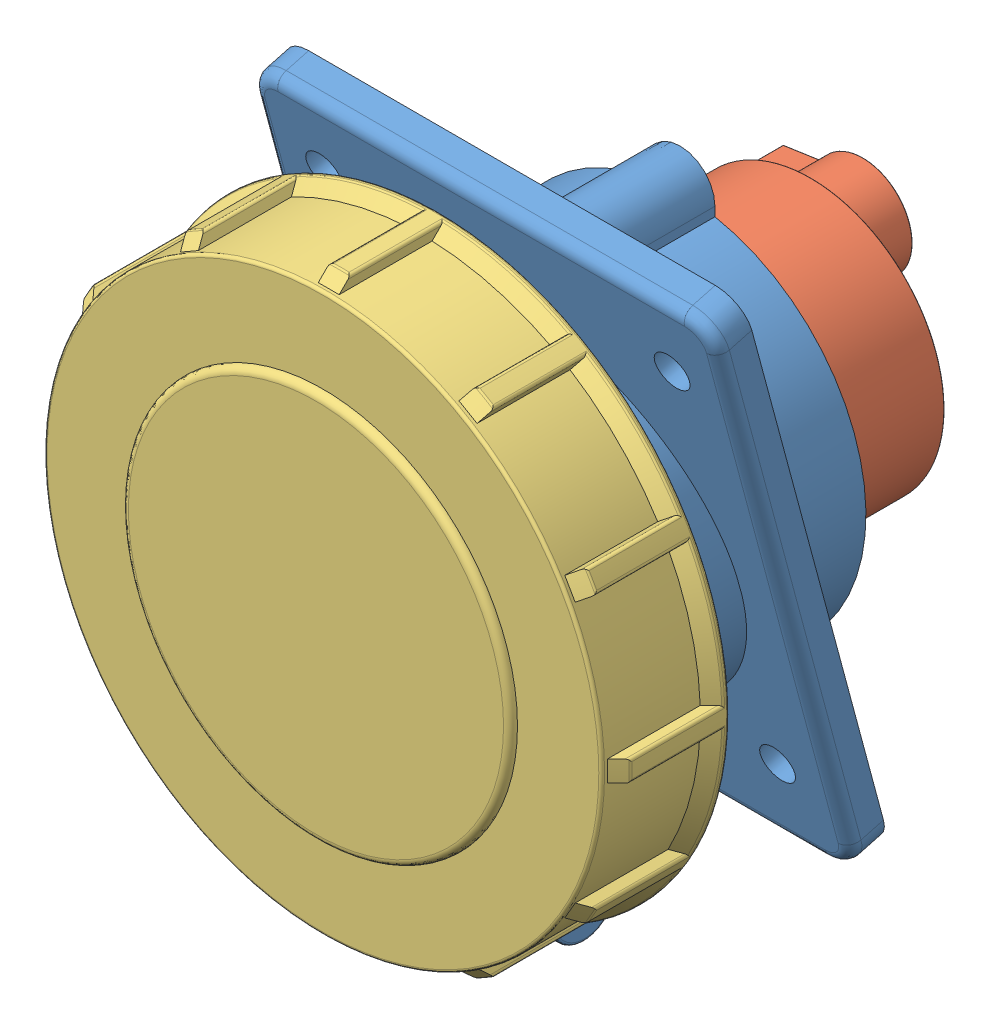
SolidWorks assembly Сборка 4242.SLDASM, configuration По умолчанию (file format 10000). Lengths in mm.
Overall size (100 105.18 94.21).
3 component instances, 3 part files, 5 mates.
Components (placement in the parent):
- Корпус 4242-1: Корпус 4242.SLDPRT [По умолчанию] at (-40.6999 12.9102 0.9777) size (80 105.18 52)
- Колодка 3242,4242-1: Колодка 3242,4242.SLDPRT [По умолчанию] at (-40.6999 12.9102 -20.0223) x (0 1 0) z (0 0 1) size (46 46 30.01)
- Крышка 3242,3252,4242,4252-1: Крышка 3242,3252,4242,4252.SLDPRT [По умолчанию] at (-40.6999 12.9102 63.9777) x (1 0 0) z (0 0 -1) size (100 105 35.2)
Mates (geometry in assembly coordinates):
- Концентричный1: concentric aligned: cylinder of Корпус 4242-1 through (-40.6999 12.9102 46.9777) axis (0 0 -1) radius 24; cylinder of Колодка 3242,4242-1 through (-40.6999 12.9102 0.9777) axis (0 0 -1) radius 23
- Параллельность1: parallel anti-aligned: plane of Корпус 4242-1 through (-80.6999 12.9102 0.9777) normal (-1 0 0); plane of Колодка 3242,4242-1 through (-44.1999 4.9102 0.9777) normal (1 0 0)
- Концентричный2: concentric aligned: cylinder of Корпус 4242-1 through (-40.6999 12.9102 52.9777) axis (0 0 -1) radius 32; cylinder of Крышка 3242,3252,4242,4252-1 through (-40.6999 12.9102 52.9777) axis (0 0 -1) radius 45
- Параллельность2: parallel aligned: plane of Корпус 4242-1 through (-0.6999 12.9102 0.9777) normal (1 0 0); plane of Крышка 3242,3252,4242,4252-1 through (-29.1999 -28.5797 41.9001) normal (1 0 0)
- Совпадение1: coincident anti-aligned: plane of Корпус 4242-1 through (-40.6999 12.9102 52.9777) normal (0 0 1); plane of Крышка 3242,3252,4242,4252-1 through (-40.6999 12.9102 52.9777) normal (0 0 -1)
